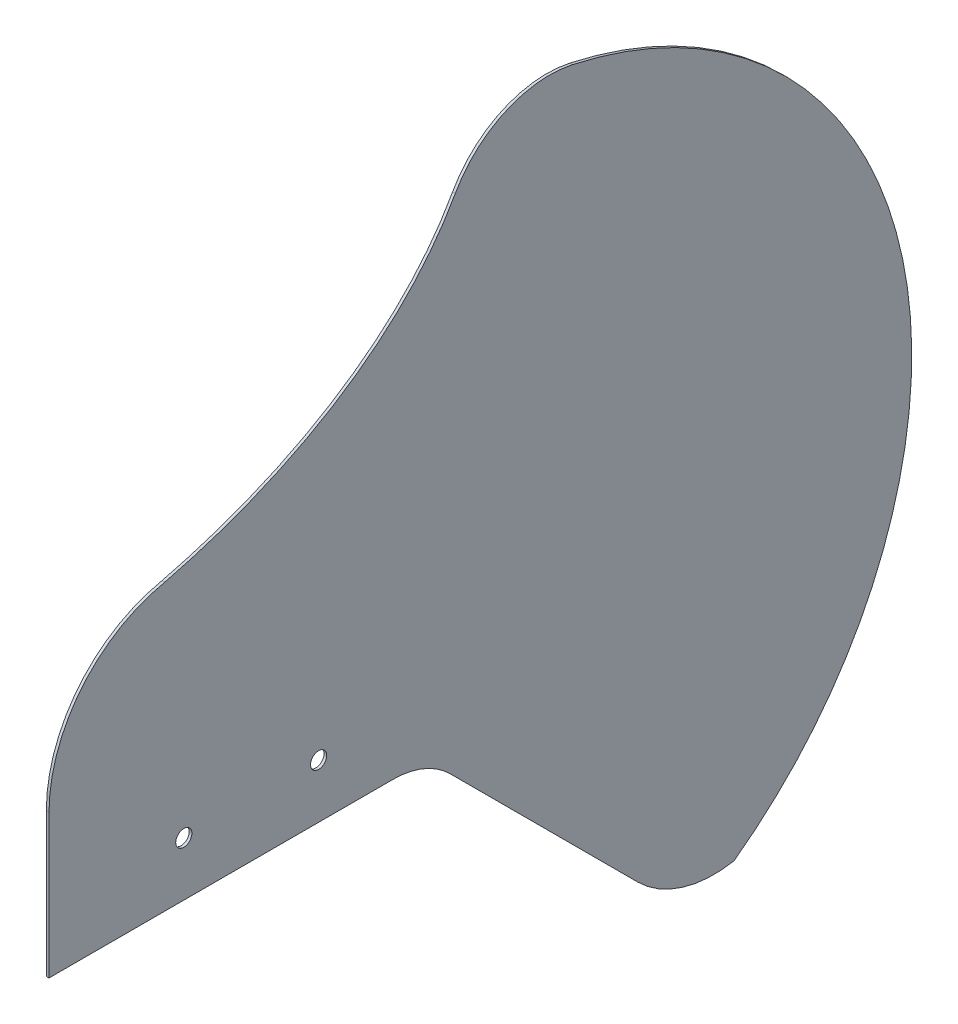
ISO-10303-21;
HEADER;
FILE_DESCRIPTION(('STEP AP214'),'2;1');
FILE_NAME('part.step','',(''),(''),'','','');
FILE_SCHEMA(('AUTOMOTIVE_DESIGN { 1 0 10303 214 1 1 1 1 }'));
ENDSEC;
DATA;
#1=APPLICATION_CONTEXT('core data for automotive mechanical design processes');
#2=APPLICATION_PROTOCOL_DEFINITION('international standard','automotive_design',2000,#1);
#3=PRODUCT_CONTEXT('',#1,'mechanical');
#4=PRODUCT('Part','Part','',(#3));
#5=PRODUCT_RELATED_PRODUCT_CATEGORY('part','',(#4));
#6=PRODUCT_DEFINITION_FORMATION('','',#4);
#7=PRODUCT_DEFINITION_CONTEXT('part definition',#1,'design');
#8=PRODUCT_DEFINITION('design','',#6,#7);
#9=PRODUCT_DEFINITION_SHAPE('','',#8);
#10=(LENGTH_UNIT() NAMED_UNIT(*) SI_UNIT(.MILLI.,.METRE.));
#11=(NAMED_UNIT(*) PLANE_ANGLE_UNIT() SI_UNIT($,.RADIAN.));
#12=(NAMED_UNIT(*) SI_UNIT($,.STERADIAN.) SOLID_ANGLE_UNIT());
#13=UNCERTAINTY_MEASURE_WITH_UNIT(LENGTH_MEASURE(1.E-05),#10,'distance_accuracy_value','');
#14=(GEOMETRIC_REPRESENTATION_CONTEXT(3) GLOBAL_UNCERTAINTY_ASSIGNED_CONTEXT((#13)) GLOBAL_UNIT_ASSIGNED_CONTEXT((#10,
#11,#12)) REPRESENTATION_CONTEXT('',''));
#15=CARTESIAN_POINT('',(0.,0.,0.));
#16=DIRECTION('',(0.,0.,1.));
#17=DIRECTION('',(1.,0.,0.));
#18=AXIS2_PLACEMENT_3D('',#15,#16,#17);
#19=CARTESIAN_POINT('',(0.5,6.62411925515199,53.248238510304));
#20=DIRECTION('',(1.,0.,0.));
#21=DIRECTION('',(0.,0.,-1.));
#22=AXIS2_PLACEMENT_3D('',#19,#20,#21);
#23=PLANE('',#22);
#24=CARTESIAN_POINT('',(0.5,-10.,55.));
#25=DIRECTION('',(1.,0.,0.));
#26=DIRECTION('',(0.,0.,-1.));
#27=AXIS2_PLACEMENT_3D('',#24,#25,#26);
#28=CIRCLE('',#27,1.5);
#29=CARTESIAN_POINT('',(0.5,-10.,53.5));
#30=VERTEX_POINT('',#29);
#31=EDGE_CURVE('E105',#30,#30,#28,.T.);
#32=ORIENTED_EDGE('',*,*,#31,.F.);
#33=EDGE_LOOP('',(#32));
#34=FACE_BOUND('',#33,.T.);
#35=DIRECTION('',(0.,-1.,0.));
#36=VECTOR('',#35,1.);
#37=CARTESIAN_POINT('',(0.5,0.,80.));
#38=LINE('',#37,#36);
#39=CARTESIAN_POINT('',(0.5,6.624119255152,80.));
#40=VERTEX_POINT('',#39);
#41=CARTESIAN_POINT('',(0.5,-20.0000000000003,80.));
#42=VERTEX_POINT('',#41);
#43=EDGE_CURVE('E138',#40,#42,#38,.T.);
#44=ORIENTED_EDGE('',*,*,#43,.T.);
#45=DIRECTION('',(0.,0.,-1.));
#46=VECTOR('',#45,1.);
#47=CARTESIAN_POINT('',(0.5,-20.0000000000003,80.));
#48=LINE('',#47,#46);
#49=CARTESIAN_POINT('',(0.5,-20.,16.2132034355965));
#50=VERTEX_POINT('',#49);
#51=EDGE_CURVE('E111',#42,#50,#48,.T.);
#52=ORIENTED_EDGE('',*,*,#51,.T.);
#53=CARTESIAN_POINT('',(0.5,-35.0000000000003,16.2132034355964));
#54=DIRECTION('',(-1.,0.,0.));
#55=DIRECTION('',(0.,0.,-1.));
#56=AXIS2_PLACEMENT_3D('',#53,#54,#55);
#57=CIRCLE('',#56,15.0000000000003);
#58=CARTESIAN_POINT('',(0.5,-24.3933982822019,5.60660171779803));
#59=VERTEX_POINT('',#58);
#60=EDGE_CURVE('E141',#50,#59,#57,.T.);
#61=ORIENTED_EDGE('',*,*,#60,.T.);
#62=DIRECTION('',(0.,-0.707106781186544,-0.707106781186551));
#63=VECTOR('',#62,1.);
#64=CARTESIAN_POINT('',(0.5,-24.3933982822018,5.60660171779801));
#65=LINE('',#64,#63);
#66=CARTESIAN_POINT('',(0.5,-59.195568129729,-29.1955681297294));
#67=VERTEX_POINT('',#66);
#68=EDGE_CURVE('E143',#59,#67,#65,.T.);
#69=ORIENTED_EDGE('',*,*,#68,.T.);
#70=CARTESIAN_POINT('',(0.5,-45.0534325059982,-43.3377037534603));
#71=DIRECTION('',(1.,0.,0.));
#72=DIRECTION('',(0.,0.,-1.));
#73=AXIS2_PLACEMENT_3D('',#70,#71,#72);
#74=CIRCLE('',#73,19.9999999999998);
#75=CARTESIAN_POINT('',(0.5,-64.707384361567,-47.0420493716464));
#76=VERTEX_POINT('',#75);
#77=EDGE_CURVE('E145',#67,#76,#74,.T.);
#78=ORIENTED_EDGE('',*,*,#77,.T.);
#79=CARTESIAN_POINT('',(0.5,0.,0.));
#80=DIRECTION('',(1.,0.,0.));
#81=DIRECTION('',(0.,0.,-1.));
#82=AXIS2_PLACEMENT_3D('',#79,#80,#81);
#83=CIRCLE('',#82,79.9999999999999);
#84=CARTESIAN_POINT('',(0.5,78.1507647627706,-17.1014024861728));
#85=VERTEX_POINT('',#84);
#86=EDGE_CURVE('E147',#76,#85,#83,.T.);
#87=ORIENTED_EDGE('',*,*,#86,.T.);
#88=CARTESIAN_POINT('',(0.5,58.613073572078,-12.8260518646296));
#89=DIRECTION('',(1.,0.,0.));
#90=DIRECTION('',(0.,0.,-1.));
#91=AXIS2_PLACEMENT_3D('',#88,#89,#90);
#92=CIRCLE('',#91,20.);
#93=CARTESIAN_POINT('',(0.5,68.33326677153,4.65301687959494));
#94=VERTEX_POINT('',#93);
#95=EDGE_CURVE('E149',#85,#94,#92,.T.);
#96=ORIENTED_EDGE('',*,*,#95,.T.);
#97=CARTESIAN_POINT('',(0.5,68.33326677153,4.65301687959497));
#98=CARTESIAN_POINT('',(0.5,59.7346372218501,9.43475563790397));
#99=CARTESIAN_POINT('',(0.5,45.0166421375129,24.1626411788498));
#100=CARTESIAN_POINT('',(0.5,35.8723267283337,46.3241466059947));
#101=CARTESIAN_POINT('',(0.5,32.8473768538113,58.5395052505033));
#102=B_SPLINE_CURVE_WITH_KNOTS('',3,(#97,#98,#99,#100,#101),.UNSPECIFIED.,.F.,.F.,(4,1,4),(0.,
0.345585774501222,0.691171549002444),.UNSPECIFIED.);
#103=CARTESIAN_POINT('',(0.5,32.8473768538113,58.5395052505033));
#104=VERTEX_POINT('',#103);
#105=EDGE_CURVE('E46',#94,#104,#102,.T.);
#106=ORIENTED_EDGE('',*,*,#105,.T.);
#107=CARTESIAN_POINT('',(0.5,6.62411925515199,53.248238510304));
#108=DIRECTION('',(1.,0.,0.));
#109=DIRECTION('',(0.,0.,-1.));
#110=AXIS2_PLACEMENT_3D('',#107,#108,#109);
#111=CIRCLE('',#110,26.751761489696);
#112=EDGE_CURVE('E41',#104,#40,#111,.T.);
#113=ORIENTED_EDGE('',*,*,#112,.T.);
#114=EDGE_LOOP('',(#44,#52,#61,#69,#78,#87,#96,#106,#113));
#115=FACE_BOUND('',#114,.T.);
#116=CARTESIAN_POINT('',(0.5,-10.,30.));
#117=DIRECTION('',(1.,0.,0.));
#118=DIRECTION('',(0.,0.,-1.));
#119=AXIS2_PLACEMENT_3D('',#116,#117,#118);
#120=CIRCLE('',#119,1.5);
#121=CARTESIAN_POINT('',(0.5,-10.,28.5));
#122=VERTEX_POINT('',#121);
#123=EDGE_CURVE('E211',#122,#122,#120,.T.);
#124=ORIENTED_EDGE('',*,*,#123,.F.);
#125=EDGE_LOOP('',(#124));
#126=FACE_BOUND('',#125,.T.);
#127=ADVANCED_FACE('F26',(#34,#115,#126),#23,.T.);
#128=CARTESIAN_POINT('',(0.,6.62411925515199,53.248238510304));
#129=DIRECTION('',(1.,0.,0.));
#130=DIRECTION('',(0.,0.,-1.));
#131=AXIS2_PLACEMENT_3D('',#128,#129,#130);
#132=PLANE('',#131);
#133=CARTESIAN_POINT('',(0.,-10.,55.));
#134=DIRECTION('',(1.,0.,0.));
#135=DIRECTION('',(0.,0.,-1.));
#136=AXIS2_PLACEMENT_3D('',#133,#134,#135);
#137=CIRCLE('',#136,1.5);
#138=CARTESIAN_POINT('',(0.,-10.,53.5));
#139=VERTEX_POINT('',#138);
#140=EDGE_CURVE('E216',#139,#139,#137,.T.);
#141=ORIENTED_EDGE('',*,*,#140,.T.);
#142=EDGE_LOOP('',(#141));
#143=FACE_BOUND('',#142,.T.);
#144=DIRECTION('',(0.,-1.,0.));
#145=VECTOR('',#144,1.);
#146=CARTESIAN_POINT('',(0.,0.,80.));
#147=LINE('',#146,#145);
#148=CARTESIAN_POINT('',(0.,6.624119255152,80.));
#149=VERTEX_POINT('',#148);
#150=CARTESIAN_POINT('',(0.,-20.0000000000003,80.));
#151=VERTEX_POINT('',#150);
#152=EDGE_CURVE('E96',#149,#151,#147,.T.);
#153=ORIENTED_EDGE('',*,*,#152,.F.);
#154=CARTESIAN_POINT('',(0.,6.62411925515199,53.248238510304));
#155=DIRECTION('',(1.,0.,0.));
#156=DIRECTION('',(0.,0.,-1.));
#157=AXIS2_PLACEMENT_3D('',#154,#155,#156);
#158=CIRCLE('',#157,26.751761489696);
#159=CARTESIAN_POINT('',(0.,32.8473768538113,58.5395052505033));
#160=VERTEX_POINT('',#159);
#161=EDGE_CURVE('E133',#160,#149,#158,.T.);
#162=ORIENTED_EDGE('',*,*,#161,.F.);
#163=CARTESIAN_POINT('',(0.,68.33326677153,4.65301687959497));
#164=CARTESIAN_POINT('',(0.,59.7346372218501,9.43475563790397));
#165=CARTESIAN_POINT('',(0.,45.0166421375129,24.1626411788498));
#166=CARTESIAN_POINT('',(0.,35.8723267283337,46.3241466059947));
#167=CARTESIAN_POINT('',(0.,32.8473768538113,58.5395052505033));
#168=B_SPLINE_CURVE_WITH_KNOTS('',3,(#163,#164,#165,#166,#167),.UNSPECIFIED.,.F.,.F.,(4,1,4),
(0.,0.345585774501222,0.691171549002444),.UNSPECIFIED.);
#169=CARTESIAN_POINT('',(0.,68.33326677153,4.65301687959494));
#170=VERTEX_POINT('',#169);
#171=EDGE_CURVE('E129',#170,#160,#168,.T.);
#172=ORIENTED_EDGE('',*,*,#171,.F.);
#173=CARTESIAN_POINT('',(0.,58.613073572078,-12.8260518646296));
#174=DIRECTION('',(1.,0.,0.));
#175=DIRECTION('',(0.,0.,-1.));
#176=AXIS2_PLACEMENT_3D('',#173,#174,#175);
#177=CIRCLE('',#176,20.);
#178=CARTESIAN_POINT('',(0.,78.1507647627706,-17.1014024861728));
#179=VERTEX_POINT('',#178);
#180=EDGE_CURVE('E127',#179,#170,#177,.T.);
#181=ORIENTED_EDGE('',*,*,#180,.F.);
#182=CARTESIAN_POINT('',(0.,0.,0.));
#183=DIRECTION('',(1.,0.,0.));
#184=DIRECTION('',(0.,0.,-1.));
#185=AXIS2_PLACEMENT_3D('',#182,#183,#184);
#186=CIRCLE('',#185,79.9999999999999);
#187=CARTESIAN_POINT('',(0.,-64.707384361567,-47.0420493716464));
#188=VERTEX_POINT('',#187);
#189=EDGE_CURVE('E125',#188,#179,#186,.T.);
#190=ORIENTED_EDGE('',*,*,#189,.F.);
#191=CARTESIAN_POINT('',(0.,-45.0534325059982,-43.3377037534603));
#192=DIRECTION('',(1.,0.,0.));
#193=DIRECTION('',(0.,0.,-1.));
#194=AXIS2_PLACEMENT_3D('',#191,#192,#193);
#195=CIRCLE('',#194,19.9999999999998);
#196=CARTESIAN_POINT('',(0.,-59.195568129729,-29.1955681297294));
#197=VERTEX_POINT('',#196);
#198=EDGE_CURVE('E123',#197,#188,#195,.T.);
#199=ORIENTED_EDGE('',*,*,#198,.F.);
#200=DIRECTION('',(0.,-0.707106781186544,-0.707106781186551));
#201=VECTOR('',#200,1.);
#202=CARTESIAN_POINT('',(0.,-24.3933982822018,5.60660171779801));
#203=LINE('',#202,#201);
#204=CARTESIAN_POINT('',(0.,-24.3933982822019,5.60660171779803));
#205=VERTEX_POINT('',#204);
#206=EDGE_CURVE('E118',#205,#197,#203,.T.);
#207=ORIENTED_EDGE('',*,*,#206,.F.);
#208=CARTESIAN_POINT('',(0.,-35.0000000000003,16.2132034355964));
#209=DIRECTION('',(-1.,0.,0.));
#210=DIRECTION('',(0.,0.,-1.));
#211=AXIS2_PLACEMENT_3D('',#208,#209,#210);
#212=CIRCLE('',#211,15.0000000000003);
#213=CARTESIAN_POINT('',(0.,-20.,16.2132034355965));
#214=VERTEX_POINT('',#213);
#215=EDGE_CURVE('E116',#214,#205,#212,.T.);
#216=ORIENTED_EDGE('',*,*,#215,.F.);
#217=DIRECTION('',(0.,0.,-1.));
#218=VECTOR('',#217,1.);
#219=CARTESIAN_POINT('',(0.,-20.0000000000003,80.));
#220=LINE('',#219,#218);
#221=EDGE_CURVE('E104',#151,#214,#220,.T.);
#222=ORIENTED_EDGE('',*,*,#221,.F.);
#223=EDGE_LOOP('',(#153,#162,#172,#181,#190,#199,#207,#216,#222));
#224=FACE_BOUND('',#223,.T.);
#225=CARTESIAN_POINT('',(0.,-10.,30.));
#226=DIRECTION('',(1.,0.,0.));
#227=DIRECTION('',(0.,0.,-1.));
#228=AXIS2_PLACEMENT_3D('',#225,#226,#227);
#229=CIRCLE('',#228,1.5);
#230=CARTESIAN_POINT('',(0.,-10.,28.5));
#231=VERTEX_POINT('',#230);
#232=EDGE_CURVE('E214',#231,#231,#229,.T.);
#233=ORIENTED_EDGE('',*,*,#232,.T.);
#234=EDGE_LOOP('',(#233));
#235=FACE_BOUND('',#234,.T.);
#236=ADVANCED_FACE('F113',(#143,#224,#235),#132,.F.);
#237=CARTESIAN_POINT('',(0.5,0.,80.));
#238=DIRECTION('',(0.,0.,-1.));
#239=DIRECTION('',(-1.,0.,0.));
#240=AXIS2_PLACEMENT_3D('',#237,#238,#239);
#241=PLANE('',#240);
#242=ORIENTED_EDGE('',*,*,#152,.T.);
#243=DIRECTION('',(-1.,0.,0.));
#244=VECTOR('',#243,1.);
#245=CARTESIAN_POINT('',(0.5,-20.0000000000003,80.));
#246=LINE('',#245,#244);
#247=EDGE_CURVE('E11',#42,#151,#246,.T.);
#248=ORIENTED_EDGE('',*,*,#247,.F.);
#249=ORIENTED_EDGE('',*,*,#43,.F.);
#250=DIRECTION('',(-1.,0.,0.));
#251=VECTOR('',#250,1.);
#252=CARTESIAN_POINT('',(0.5,6.624119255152,80.));
#253=LINE('',#252,#251);
#254=EDGE_CURVE('E99',#40,#149,#253,.T.);
#255=ORIENTED_EDGE('',*,*,#254,.T.);
#256=EDGE_LOOP('',(#242,#248,#249,#255));
#257=FACE_BOUND('',#256,.T.);
#258=ADVANCED_FACE('F28',(#257),#241,.F.);
#259=CARTESIAN_POINT('',(0.5,-20.0000000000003,80.));
#260=DIRECTION('',(0.,1.,0.));
#261=DIRECTION('',(0.,0.,1.));
#262=AXIS2_PLACEMENT_3D('',#259,#260,#261);
#263=PLANE('',#262);
#264=ORIENTED_EDGE('',*,*,#221,.T.);
#265=DIRECTION('',(-1.,0.,0.));
#266=VECTOR('',#265,1.);
#267=CARTESIAN_POINT('',(0.5,-20.,16.2132034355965));
#268=LINE('',#267,#266);
#269=EDGE_CURVE('E34',#50,#214,#268,.T.);
#270=ORIENTED_EDGE('',*,*,#269,.F.);
#271=ORIENTED_EDGE('',*,*,#51,.F.);
#272=ORIENTED_EDGE('',*,*,#247,.T.);
#273=EDGE_LOOP('',(#264,#270,#271,#272));
#274=FACE_BOUND('',#273,.T.);
#275=ADVANCED_FACE('F108',(#274),#263,.F.);
#276=CARTESIAN_POINT('',(0.5,-35.0000000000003,16.2132034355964));
#277=DIRECTION('',(-1.,0.,0.));
#278=DIRECTION('',(0.,0.,1.));
#279=AXIS2_PLACEMENT_3D('',#276,#277,#278);
#280=CYLINDRICAL_SURFACE('',#279,15.0000000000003);
#281=ORIENTED_EDGE('',*,*,#215,.T.);
#282=DIRECTION('',(-1.,0.,0.));
#283=VECTOR('',#282,1.);
#284=CARTESIAN_POINT('',(0.5,-24.3933982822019,5.60660171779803));
#285=LINE('',#284,#283);
#286=EDGE_CURVE('E296',#59,#205,#285,.T.);
#287=ORIENTED_EDGE('',*,*,#286,.F.);
#288=ORIENTED_EDGE('',*,*,#60,.F.);
#289=ORIENTED_EDGE('',*,*,#269,.T.);
#290=EDGE_LOOP('',(#281,#287,#288,#289));
#291=FACE_BOUND('',#290,.T.);
#292=ADVANCED_FACE('F182',(#291),#280,.F.);
#293=CARTESIAN_POINT('',(0.5,-24.3933982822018,5.60660171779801));
#294=DIRECTION('',(0.,0.707106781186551,-0.707106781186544));
#295=DIRECTION('',(0.,0.707106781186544,0.707106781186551));
#296=AXIS2_PLACEMENT_3D('',#293,#294,#295);
#297=PLANE('',#296);
#298=ORIENTED_EDGE('',*,*,#206,.T.);
#299=DIRECTION('',(-1.,0.,0.));
#300=VECTOR('',#299,1.);
#301=CARTESIAN_POINT('',(0.5,-59.195568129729,-29.1955681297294));
#302=LINE('',#301,#300);
#303=EDGE_CURVE('E293',#67,#197,#302,.T.);
#304=ORIENTED_EDGE('',*,*,#303,.F.);
#305=ORIENTED_EDGE('',*,*,#68,.F.);
#306=ORIENTED_EDGE('',*,*,#286,.T.);
#307=EDGE_LOOP('',(#298,#304,#305,#306));
#308=FACE_BOUND('',#307,.T.);
#309=ADVANCED_FACE('F178',(#308),#297,.F.);
#310=CARTESIAN_POINT('',(0.5,-45.0534325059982,-43.3377037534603));
#311=DIRECTION('',(-1.,0.,0.));
#312=DIRECTION('',(0.,0.,1.));
#313=AXIS2_PLACEMENT_3D('',#310,#311,#312);
#314=CYLINDRICAL_SURFACE('',#313,19.9999999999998);
#315=ORIENTED_EDGE('',*,*,#198,.T.);
#316=DIRECTION('',(-1.,0.,0.));
#317=VECTOR('',#316,1.);
#318=CARTESIAN_POINT('',(0.5,-64.707384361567,-47.0420493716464));
#319=LINE('',#318,#317);
#320=EDGE_CURVE('E287',#76,#188,#319,.T.);
#321=ORIENTED_EDGE('',*,*,#320,.F.);
#322=ORIENTED_EDGE('',*,*,#77,.F.);
#323=ORIENTED_EDGE('',*,*,#303,.T.);
#324=EDGE_LOOP('',(#315,#321,#322,#323));
#325=FACE_BOUND('',#324,.T.);
#326=ADVANCED_FACE('F174',(#325),#314,.T.);
#327=CARTESIAN_POINT('',(0.5,0.,0.));
#328=DIRECTION('',(-1.,0.,0.));
#329=DIRECTION('',(0.,0.,1.));
#330=AXIS2_PLACEMENT_3D('',#327,#328,#329);
#331=CYLINDRICAL_SURFACE('',#330,79.9999999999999);
#332=ORIENTED_EDGE('',*,*,#189,.T.);
#333=DIRECTION('',(-1.,0.,0.));
#334=VECTOR('',#333,1.);
#335=CARTESIAN_POINT('',(0.5,78.1507647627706,-17.1014024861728));
#336=LINE('',#335,#334);
#337=EDGE_CURVE('E284',#85,#179,#336,.T.);
#338=ORIENTED_EDGE('',*,*,#337,.F.);
#339=ORIENTED_EDGE('',*,*,#86,.F.);
#340=ORIENTED_EDGE('',*,*,#320,.T.);
#341=EDGE_LOOP('',(#332,#338,#339,#340));
#342=FACE_BOUND('',#341,.T.);
#343=ADVANCED_FACE('F170',(#342),#331,.T.);
#344=CARTESIAN_POINT('',(0.5,58.613073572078,-12.8260518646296));
#345=DIRECTION('',(-1.,0.,0.));
#346=DIRECTION('',(0.,0.,1.));
#347=AXIS2_PLACEMENT_3D('',#344,#345,#346);
#348=CYLINDRICAL_SURFACE('',#347,20.);
#349=ORIENTED_EDGE('',*,*,#180,.T.);
#350=DIRECTION('',(-1.,0.,0.));
#351=VECTOR('',#350,1.);
#352=CARTESIAN_POINT('',(0.5,68.33326677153,4.65301687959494));
#353=LINE('',#352,#351);
#354=EDGE_CURVE('E282',#94,#170,#353,.T.);
#355=ORIENTED_EDGE('',*,*,#354,.F.);
#356=ORIENTED_EDGE('',*,*,#95,.F.);
#357=ORIENTED_EDGE('',*,*,#337,.T.);
#358=EDGE_LOOP('',(#349,#355,#356,#357));
#359=FACE_BOUND('',#358,.T.);
#360=ADVANCED_FACE('F165',(#359),#348,.T.);
#361=DIRECTION('',(-1.,0.,0.));
#362=VECTOR('',#361,1.);
#363=SURFACE_OF_LINEAR_EXTRUSION('',#102,#362);
#364=ORIENTED_EDGE('',*,*,#171,.T.);
#365=DIRECTION('',(-1.,0.,0.));
#366=VECTOR('',#365,1.);
#367=CARTESIAN_POINT('',(0.5,32.8473768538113,58.5395052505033));
#368=LINE('',#367,#366);
#369=EDGE_CURVE('E276',#104,#160,#368,.T.);
#370=ORIENTED_EDGE('',*,*,#369,.F.);
#371=ORIENTED_EDGE('',*,*,#105,.F.);
#372=ORIENTED_EDGE('',*,*,#354,.T.);
#373=EDGE_LOOP('',(#364,#370,#371,#372));
#374=FACE_BOUND('',#373,.T.);
#375=ADVANCED_FACE('F160',(#374),#363,.F.);
#376=CARTESIAN_POINT('',(0.5,6.62411925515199,53.248238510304));
#377=DIRECTION('',(-1.,0.,0.));
#378=DIRECTION('',(0.,0.,1.));
#379=AXIS2_PLACEMENT_3D('',#376,#377,#378);
#380=CYLINDRICAL_SURFACE('',#379,26.751761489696);
#381=ORIENTED_EDGE('',*,*,#161,.T.);
#382=ORIENTED_EDGE('',*,*,#254,.F.);
#383=ORIENTED_EDGE('',*,*,#112,.F.);
#384=ORIENTED_EDGE('',*,*,#369,.T.);
#385=EDGE_LOOP('',(#381,#382,#383,#384));
#386=FACE_BOUND('',#385,.T.);
#387=ADVANCED_FACE('F164',(#386),#380,.T.);
#388=CARTESIAN_POINT('',(0.5,-10.,55.));
#389=DIRECTION('',(-1.,0.,0.));
#390=DIRECTION('',(0.,0.,1.));
#391=AXIS2_PLACEMENT_3D('',#388,#389,#390);
#392=CYLINDRICAL_SURFACE('',#391,1.5);
#393=ORIENTED_EDGE('',*,*,#31,.T.);
#394=EDGE_LOOP('',(#393));
#395=FACE_BOUND('',#394,.T.);
#396=ORIENTED_EDGE('',*,*,#140,.F.);
#397=EDGE_LOOP('',(#396));
#398=FACE_BOUND('',#397,.T.);
#399=ADVANCED_FACE('F199',(#395,#398),#392,.F.);
#400=CARTESIAN_POINT('',(0.5,-10.,30.));
#401=DIRECTION('',(-1.,0.,0.));
#402=DIRECTION('',(0.,0.,1.));
#403=AXIS2_PLACEMENT_3D('',#400,#401,#402);
#404=CYLINDRICAL_SURFACE('',#403,1.5);
#405=ORIENTED_EDGE('',*,*,#123,.T.);
#406=EDGE_LOOP('',(#405));
#407=FACE_BOUND('',#406,.T.);
#408=ORIENTED_EDGE('',*,*,#232,.F.);
#409=EDGE_LOOP('',(#408));
#410=FACE_BOUND('',#409,.T.);
#411=ADVANCED_FACE('F202',(#407,#410),#404,.F.);
#412=CLOSED_SHELL('',(#127,#236,#258,#275,#292,#309,#326,#343,#360,#375,#387,#399,#411));
#413=MANIFOLD_SOLID_BREP('B2',#412);
#414=ADVANCED_BREP_SHAPE_REPRESENTATION('',(#18,#413),#14);
#415=SHAPE_DEFINITION_REPRESENTATION(#9,#414);
ENDSEC;
END-ISO-10303-21;
